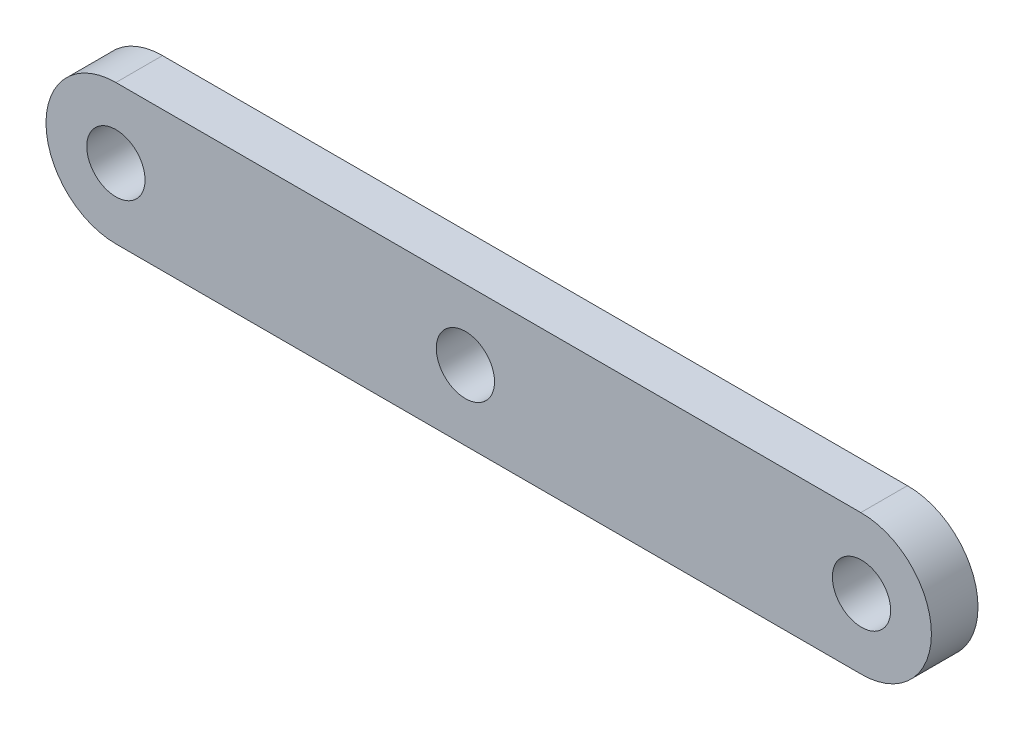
from build123d import *

# Parameters (mm, degrees)
SKETCH_1_R      = 2.5
EXTRUDE_1_DEPTH = 4


with BuildPart() as part:
    # Sketch 1 → Extrude 1 (new body)
    with BuildSketch(Plane.XY):
        with BuildLine():
            Line((-15, 6), (48.940025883, 5.999700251))
            ThreePointArc((48.940025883, 5.999700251), (54.999999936, -0.000874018), (48.938277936, -5.999682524))
            Line((48.938277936, -5.999682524), (-14.999073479, -5.999999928))
            ThreePointArc((-14.999073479, -5.999999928), (-20.999999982, -0.00046326), (-15, 6))
        make_face()
        with Locations((49, 0)):
            Circle(SKETCH_1_R, mode=Mode.SUBTRACT)
        with Locations((15, 0)):
            Circle(SKETCH_1_R, mode=Mode.SUBTRACT)
        with Locations((-15, 0)):
            Circle(SKETCH_1_R, mode=Mode.SUBTRACT)
    extrude(amount=EXTRUDE_1_DEPTH)


solid = part.part
